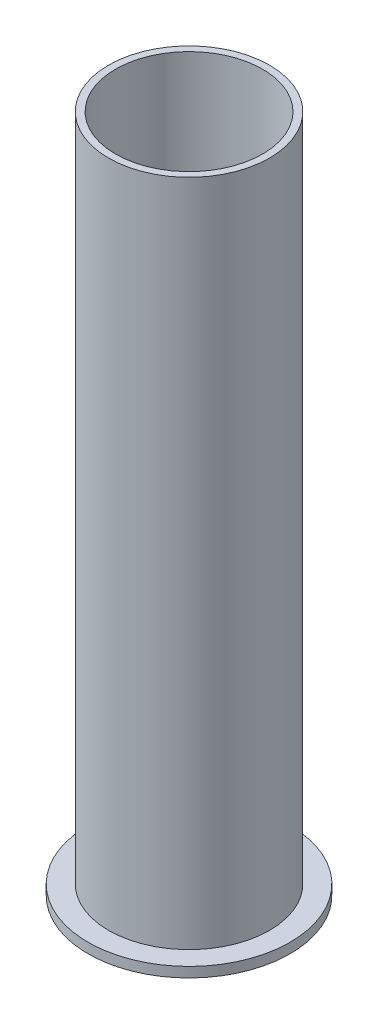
from build123d import *

# Parameters (mm, degrees)
SKETCH1_R           = 6.3246
SKETCH1_R_2         = 5.7785
BOSS_EXTRUDE1_DEPTH = 53.34
SKETCH2_R           = 7.9375
SKETCH2_R_2         = 5.7785
BOSS_EXTRUDE2_DEPTH = 0.7874


with BuildPart() as part:
    # Sketch1 → Boss-Extrude1 (new body)
    with BuildSketch(Plane(origin=(0, 0, 0), x_dir=(1, 0, 0), z_dir=(0, 1, 0))):
        with Locations(Location((0, 0, 0), (0, 0, 270))):
            Circle(SKETCH1_R)
        with Locations(Location((0, 0, 0), (0, 0, 270))):
            Circle(SKETCH1_R_2, mode=Mode.SUBTRACT)
    extrude(amount=BOSS_EXTRUDE1_DEPTH)

    # Sketch2 → Boss-Extrude2 (add)
    with BuildSketch(Plane.XZ):
        with Locations(Location((0, 0, 0), (0, 0, 270))):
            Circle(SKETCH2_R)
        with Locations(Location((0, 0, 0), (0, 0, 90))):
            Circle(SKETCH2_R_2, mode=Mode.SUBTRACT)
    extrude(amount=-BOSS_EXTRUDE2_DEPTH)


solid = part.part
